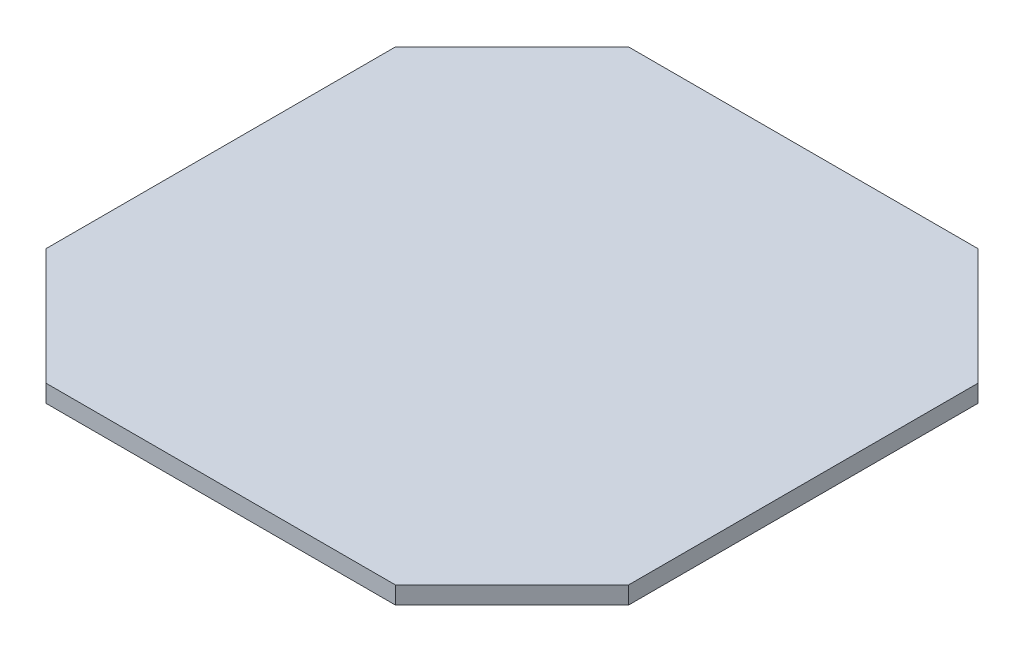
ISO-10303-21;
HEADER;
FILE_DESCRIPTION(('STEP AP214'),'2;1');
FILE_NAME('part.step','',(''),(''),'','','');
FILE_SCHEMA(('AUTOMOTIVE_DESIGN { 1 0 10303 214 1 1 1 1 }'));
ENDSEC;
DATA;
#1=APPLICATION_CONTEXT('core data for automotive mechanical design processes');
#2=APPLICATION_PROTOCOL_DEFINITION('international standard','automotive_design',2000,#1);
#3=PRODUCT_CONTEXT('',#1,'mechanical');
#4=PRODUCT('Part','Part','',(#3));
#5=PRODUCT_RELATED_PRODUCT_CATEGORY('part','',(#4));
#6=PRODUCT_DEFINITION_FORMATION('','',#4);
#7=PRODUCT_DEFINITION_CONTEXT('part definition',#1,'design');
#8=PRODUCT_DEFINITION('design','',#6,#7);
#9=PRODUCT_DEFINITION_SHAPE('','',#8);
#10=(LENGTH_UNIT() NAMED_UNIT(*) SI_UNIT(.MILLI.,.METRE.));
#11=(NAMED_UNIT(*) PLANE_ANGLE_UNIT() SI_UNIT($,.RADIAN.));
#12=(NAMED_UNIT(*) SI_UNIT($,.STERADIAN.) SOLID_ANGLE_UNIT());
#13=UNCERTAINTY_MEASURE_WITH_UNIT(LENGTH_MEASURE(1.E-05),#10,'distance_accuracy_value','');
#14=(GEOMETRIC_REPRESENTATION_CONTEXT(3) GLOBAL_UNCERTAINTY_ASSIGNED_CONTEXT((#13)) GLOBAL_UNIT_ASSIGNED_CONTEXT((#10,
#11,#12)) REPRESENTATION_CONTEXT('',''));
#15=CARTESIAN_POINT('',(0.,0.,0.));
#16=DIRECTION('',(0.,0.,1.));
#17=DIRECTION('',(1.,0.,0.));
#18=AXIS2_PLACEMENT_3D('',#15,#16,#17);
#19=CARTESIAN_POINT('',(-63.5,3.81,-63.5));
#20=DIRECTION('',(1.,0.,0.));
#21=DIRECTION('',(0.,0.,-1.));
#22=AXIS2_PLACEMENT_3D('',#19,#20,#21);
#23=PLANE('',#22);
#24=DIRECTION('',(0.,0.,1.));
#25=VECTOR('',#24,1.);
#26=CARTESIAN_POINT('',(-63.5,0.,-63.5));
#27=LINE('',#26,#25);
#28=CARTESIAN_POINT('',(-63.5,0.,-38.1));
#29=VERTEX_POINT('',#28);
#30=CARTESIAN_POINT('',(-63.5,0.,38.0999999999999));
#31=VERTEX_POINT('',#30);
#32=EDGE_CURVE('E136',#29,#31,#27,.T.);
#33=ORIENTED_EDGE('',*,*,#32,.T.);
#34=DIRECTION('',(0.,1.,0.));
#35=VECTOR('',#34,1.);
#36=CARTESIAN_POINT('',(-63.5,3.81,38.0999999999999));
#37=LINE('',#36,#35);
#38=CARTESIAN_POINT('',(-63.5,3.81,38.0999999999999));
#39=VERTEX_POINT('',#38);
#40=EDGE_CURVE('E111',#31,#39,#37,.T.);
#41=ORIENTED_EDGE('',*,*,#40,.T.);
#42=DIRECTION('',(0.,0.,1.));
#43=VECTOR('',#42,1.);
#44=CARTESIAN_POINT('',(-63.5,3.81,-63.5));
#45=LINE('',#44,#43);
#46=CARTESIAN_POINT('',(-63.5,3.81,-38.1));
#47=VERTEX_POINT('',#46);
#48=EDGE_CURVE('E148',#47,#39,#45,.T.);
#49=ORIENTED_EDGE('',*,*,#48,.F.);
#50=DIRECTION('',(0.,-1.,0.));
#51=VECTOR('',#50,1.);
#52=CARTESIAN_POINT('',(-63.5,3.81,-38.1));
#53=LINE('',#52,#51);
#54=EDGE_CURVE('E117',#47,#29,#53,.T.);
#55=ORIENTED_EDGE('',*,*,#54,.T.);
#56=EDGE_LOOP('',(#33,#41,#49,#55));
#57=FACE_BOUND('',#56,.T.);
#58=ADVANCED_FACE('F39',(#57),#23,.F.);
#59=CARTESIAN_POINT('',(-63.5,3.81,63.5));
#60=DIRECTION('',(0.,0.,-1.));
#61=DIRECTION('',(-1.,0.,0.));
#62=AXIS2_PLACEMENT_3D('',#59,#60,#61);
#63=PLANE('',#62);
#64=DIRECTION('',(1.,0.,0.));
#65=VECTOR('',#64,1.);
#66=CARTESIAN_POINT('',(-63.5,3.81,63.5));
#67=LINE('',#66,#65);
#68=CARTESIAN_POINT('',(-38.1,3.81,63.5));
#69=VERTEX_POINT('',#68);
#70=CARTESIAN_POINT('',(38.1,3.81,63.5));
#71=VERTEX_POINT('',#70);
#72=EDGE_CURVE('E127',#69,#71,#67,.T.);
#73=ORIENTED_EDGE('',*,*,#72,.F.);
#74=DIRECTION('',(0.,-1.,0.));
#75=VECTOR('',#74,1.);
#76=CARTESIAN_POINT('',(-38.1,3.81,63.5));
#77=LINE('',#76,#75);
#78=CARTESIAN_POINT('',(-38.1,0.,63.5));
#79=VERTEX_POINT('',#78);
#80=EDGE_CURVE('E110',#69,#79,#77,.T.);
#81=ORIENTED_EDGE('',*,*,#80,.T.);
#82=DIRECTION('',(1.,0.,0.));
#83=VECTOR('',#82,1.);
#84=CARTESIAN_POINT('',(-63.5,0.,63.5));
#85=LINE('',#84,#83);
#86=CARTESIAN_POINT('',(38.1,0.,63.5));
#87=VERTEX_POINT('',#86);
#88=EDGE_CURVE('E124',#79,#87,#85,.T.);
#89=ORIENTED_EDGE('',*,*,#88,.T.);
#90=DIRECTION('',(0.,1.,0.));
#91=VECTOR('',#90,1.);
#92=CARTESIAN_POINT('',(38.1,3.81,63.5));
#93=LINE('',#92,#91);
#94=EDGE_CURVE('E130',#87,#71,#93,.T.);
#95=ORIENTED_EDGE('',*,*,#94,.T.);
#96=EDGE_LOOP('',(#73,#81,#89,#95));
#97=FACE_BOUND('',#96,.T.);
#98=ADVANCED_FACE('F123',(#97),#63,.F.);
#99=CARTESIAN_POINT('',(63.5,3.81,-63.5));
#100=DIRECTION('',(-1.,0.,0.));
#101=DIRECTION('',(0.,0.,1.));
#102=AXIS2_PLACEMENT_3D('',#99,#100,#101);
#103=PLANE('',#102);
#104=DIRECTION('',(0.,0.,-1.));
#105=VECTOR('',#104,1.);
#106=CARTESIAN_POINT('',(63.5,3.81,-63.5));
#107=LINE('',#106,#105);
#108=CARTESIAN_POINT('',(63.5,3.81,38.1));
#109=VERTEX_POINT('',#108);
#110=CARTESIAN_POINT('',(63.5,3.81,-38.0999999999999));
#111=VERTEX_POINT('',#110);
#112=EDGE_CURVE('E184',#109,#111,#107,.T.);
#113=ORIENTED_EDGE('',*,*,#112,.F.);
#114=DIRECTION('',(0.,-1.,0.));
#115=VECTOR('',#114,1.);
#116=CARTESIAN_POINT('',(63.5,3.81,38.1));
#117=LINE('',#116,#115);
#118=CARTESIAN_POINT('',(63.5,0.,38.1));
#119=VERTEX_POINT('',#118);
#120=EDGE_CURVE('E178',#109,#119,#117,.T.);
#121=ORIENTED_EDGE('',*,*,#120,.T.);
#122=DIRECTION('',(0.,0.,-1.));
#123=VECTOR('',#122,1.);
#124=CARTESIAN_POINT('',(63.5,0.,-63.5));
#125=LINE('',#124,#123);
#126=CARTESIAN_POINT('',(63.5,0.,-38.0999999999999));
#127=VERTEX_POINT('',#126);
#128=EDGE_CURVE('E135',#119,#127,#125,.T.);
#129=ORIENTED_EDGE('',*,*,#128,.T.);
#130=DIRECTION('',(0.,1.,0.));
#131=VECTOR('',#130,1.);
#132=CARTESIAN_POINT('',(63.5,3.81,-38.0999999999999));
#133=LINE('',#132,#131);
#134=EDGE_CURVE('E175',#127,#111,#133,.T.);
#135=ORIENTED_EDGE('',*,*,#134,.T.);
#136=EDGE_LOOP('',(#113,#121,#129,#135));
#137=FACE_BOUND('',#136,.T.);
#138=ADVANCED_FACE('F205',(#137),#103,.F.);
#139=CARTESIAN_POINT('',(-63.5,3.81,-63.5));
#140=DIRECTION('',(0.,0.,1.));
#141=DIRECTION('',(1.,0.,0.));
#142=AXIS2_PLACEMENT_3D('',#139,#140,#141);
#143=PLANE('',#142);
#144=DIRECTION('',(-1.,0.,0.));
#145=VECTOR('',#144,1.);
#146=CARTESIAN_POINT('',(-63.5,3.81,-63.5));
#147=LINE('',#146,#145);
#148=CARTESIAN_POINT('',(38.1,3.81,-63.5));
#149=VERTEX_POINT('',#148);
#150=CARTESIAN_POINT('',(-38.1,3.81,-63.5));
#151=VERTEX_POINT('',#150);
#152=EDGE_CURVE('E150',#149,#151,#147,.T.);
#153=ORIENTED_EDGE('',*,*,#152,.F.);
#154=DIRECTION('',(0.,-1.,0.));
#155=VECTOR('',#154,1.);
#156=CARTESIAN_POINT('',(38.1,3.81,-63.5));
#157=LINE('',#156,#155);
#158=CARTESIAN_POINT('',(38.1,0.,-63.5));
#159=VERTEX_POINT('',#158);
#160=EDGE_CURVE('E11',#149,#159,#157,.T.);
#161=ORIENTED_EDGE('',*,*,#160,.T.);
#162=DIRECTION('',(-1.,0.,0.));
#163=VECTOR('',#162,1.);
#164=CARTESIAN_POINT('',(-63.5,0.,-63.5));
#165=LINE('',#164,#163);
#166=CARTESIAN_POINT('',(-38.1,0.,-63.5));
#167=VERTEX_POINT('',#166);
#168=EDGE_CURVE('E141',#159,#167,#165,.T.);
#169=ORIENTED_EDGE('',*,*,#168,.T.);
#170=DIRECTION('',(0.,1.,0.));
#171=VECTOR('',#170,1.);
#172=CARTESIAN_POINT('',(-38.1,3.81,-63.5));
#173=LINE('',#172,#171);
#174=EDGE_CURVE('E48',#167,#151,#173,.T.);
#175=ORIENTED_EDGE('',*,*,#174,.T.);
#176=EDGE_LOOP('',(#153,#161,#169,#175));
#177=FACE_BOUND('',#176,.T.);
#178=ADVANCED_FACE('F198',(#177),#143,.F.);
#179=CARTESIAN_POINT('',(0.,3.81,0.));
#180=DIRECTION('',(0.,1.,0.));
#181=DIRECTION('',(0.,0.,1.));
#182=AXIS2_PLACEMENT_3D('',#179,#180,#181);
#183=PLANE('',#182);
#184=ORIENTED_EDGE('',*,*,#48,.T.);
#185=DIRECTION('',(-0.707106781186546,0.,-0.707106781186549));
#186=VECTOR('',#185,1.);
#187=CARTESIAN_POINT('',(-50.8000000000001,3.81,50.7999999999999));
#188=LINE('',#187,#186);
#189=EDGE_CURVE('E172',#39,#69,#188,.F.);
#190=ORIENTED_EDGE('',*,*,#189,.T.);
#191=ORIENTED_EDGE('',*,*,#72,.T.);
#192=DIRECTION('',(-0.707106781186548,0.,0.707106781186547));
#193=VECTOR('',#192,1.);
#194=CARTESIAN_POINT('',(50.7999999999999,3.81,50.8000000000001));
#195=LINE('',#194,#193);
#196=EDGE_CURVE('E169',#71,#109,#195,.F.);
#197=ORIENTED_EDGE('',*,*,#196,.T.);
#198=ORIENTED_EDGE('',*,*,#112,.T.);
#199=DIRECTION('',(0.707106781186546,0.,0.707106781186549));
#200=VECTOR('',#199,1.);
#201=CARTESIAN_POINT('',(50.8000000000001,3.81,-50.7999999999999));
#202=LINE('',#201,#200);
#203=EDGE_CURVE('E61',#111,#149,#202,.F.);
#204=ORIENTED_EDGE('',*,*,#203,.T.);
#205=ORIENTED_EDGE('',*,*,#152,.T.);
#206=DIRECTION('',(0.707106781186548,0.,-0.707106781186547));
#207=VECTOR('',#206,1.);
#208=CARTESIAN_POINT('',(-50.7999999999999,3.81,-50.8000000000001));
#209=LINE('',#208,#207);
#210=EDGE_CURVE('E164',#151,#47,#209,.F.);
#211=ORIENTED_EDGE('',*,*,#210,.T.);
#212=EDGE_LOOP('',(#184,#190,#191,#197,#198,#204,#205,#211));
#213=FACE_BOUND('',#212,.T.);
#214=ADVANCED_FACE('F192',(#213),#183,.T.);
#215=CARTESIAN_POINT('',(0.,0.,0.));
#216=DIRECTION('',(0.,1.,0.));
#217=DIRECTION('',(0.,0.,1.));
#218=AXIS2_PLACEMENT_3D('',#215,#216,#217);
#219=PLANE('',#218);
#220=ORIENTED_EDGE('',*,*,#88,.F.);
#221=DIRECTION('',(0.707106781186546,0.,0.707106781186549));
#222=VECTOR('',#221,1.);
#223=CARTESIAN_POINT('',(-38.1,0.,63.5));
#224=LINE('',#223,#222);
#225=EDGE_CURVE('E106',#79,#31,#224,.F.);
#226=ORIENTED_EDGE('',*,*,#225,.T.);
#227=ORIENTED_EDGE('',*,*,#32,.F.);
#228=DIRECTION('',(-0.707106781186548,0.,0.707106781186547));
#229=VECTOR('',#228,1.);
#230=CARTESIAN_POINT('',(-63.5,0.,-38.1));
#231=LINE('',#230,#229);
#232=EDGE_CURVE('E129',#29,#167,#231,.F.);
#233=ORIENTED_EDGE('',*,*,#232,.T.);
#234=ORIENTED_EDGE('',*,*,#168,.F.);
#235=DIRECTION('',(-0.707106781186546,0.,-0.707106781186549));
#236=VECTOR('',#235,1.);
#237=CARTESIAN_POINT('',(38.1,0.,-63.5));
#238=LINE('',#237,#236);
#239=EDGE_CURVE('E154',#159,#127,#238,.F.);
#240=ORIENTED_EDGE('',*,*,#239,.T.);
#241=ORIENTED_EDGE('',*,*,#128,.F.);
#242=DIRECTION('',(0.707106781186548,0.,-0.707106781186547));
#243=VECTOR('',#242,1.);
#244=CARTESIAN_POINT('',(63.5,0.,38.1));
#245=LINE('',#244,#243);
#246=EDGE_CURVE('E118',#119,#87,#245,.F.);
#247=ORIENTED_EDGE('',*,*,#246,.T.);
#248=EDGE_LOOP('',(#220,#226,#227,#233,#234,#240,#241,#247));
#249=FACE_BOUND('',#248,.T.);
#250=ADVANCED_FACE('F132',(#249),#219,.F.);
#251=CARTESIAN_POINT('',(-38.1,3.81,63.5));
#252=DIRECTION('',(0.707106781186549,0.,-0.707106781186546));
#253=DIRECTION('',(0.,-1.,0.));
#254=AXIS2_PLACEMENT_3D('',#251,#252,#253);
#255=PLANE('',#254);
#256=ORIENTED_EDGE('',*,*,#189,.F.);
#257=ORIENTED_EDGE('',*,*,#40,.F.);
#258=ORIENTED_EDGE('',*,*,#225,.F.);
#259=ORIENTED_EDGE('',*,*,#80,.F.);
#260=EDGE_LOOP('',(#256,#257,#258,#259));
#261=FACE_BOUND('',#260,.T.);
#262=ADVANCED_FACE('F109',(#261),#255,.F.);
#263=CARTESIAN_POINT('',(63.5,3.81,38.1));
#264=DIRECTION('',(-0.707106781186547,0.,-0.707106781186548));
#265=DIRECTION('',(0.,-1.,0.));
#266=AXIS2_PLACEMENT_3D('',#263,#264,#265);
#267=PLANE('',#266);
#268=ORIENTED_EDGE('',*,*,#196,.F.);
#269=ORIENTED_EDGE('',*,*,#94,.F.);
#270=ORIENTED_EDGE('',*,*,#246,.F.);
#271=ORIENTED_EDGE('',*,*,#120,.F.);
#272=EDGE_LOOP('',(#268,#269,#270,#271));
#273=FACE_BOUND('',#272,.T.);
#274=ADVANCED_FACE('F209',(#273),#267,.F.);
#275=CARTESIAN_POINT('',(38.1,3.81,-63.5));
#276=DIRECTION('',(-0.707106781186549,0.,0.707106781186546));
#277=DIRECTION('',(0.,-1.,0.));
#278=AXIS2_PLACEMENT_3D('',#275,#276,#277);
#279=PLANE('',#278);
#280=ORIENTED_EDGE('',*,*,#203,.F.);
#281=ORIENTED_EDGE('',*,*,#134,.F.);
#282=ORIENTED_EDGE('',*,*,#239,.F.);
#283=ORIENTED_EDGE('',*,*,#160,.F.);
#284=EDGE_LOOP('',(#280,#281,#282,#283));
#285=FACE_BOUND('',#284,.T.);
#286=ADVANCED_FACE('F201',(#285),#279,.F.);
#287=CARTESIAN_POINT('',(-63.5,3.81,-38.1));
#288=DIRECTION('',(0.707106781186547,0.,0.707106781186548));
#289=DIRECTION('',(0.,-1.,0.));
#290=AXIS2_PLACEMENT_3D('',#287,#288,#289);
#291=PLANE('',#290);
#292=ORIENTED_EDGE('',*,*,#210,.F.);
#293=ORIENTED_EDGE('',*,*,#174,.F.);
#294=ORIENTED_EDGE('',*,*,#232,.F.);
#295=ORIENTED_EDGE('',*,*,#54,.F.);
#296=EDGE_LOOP('',(#292,#293,#294,#295));
#297=FACE_BOUND('',#296,.T.);
#298=ADVANCED_FACE('F41',(#297),#291,.F.);
#299=CLOSED_SHELL('',(#58,#98,#138,#178,#214,#250,#262,#274,#286,#298));
#300=MANIFOLD_SOLID_BREP('B2',#299);
#301=ADVANCED_BREP_SHAPE_REPRESENTATION('',(#18,#300),#14);
#302=SHAPE_DEFINITION_REPRESENTATION(#9,#301);
ENDSEC;
END-ISO-10303-21;
